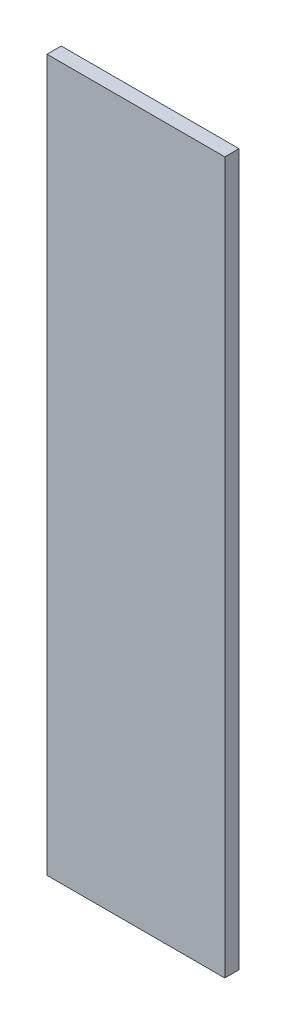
ISO-10303-21;
HEADER;
FILE_DESCRIPTION(('STEP AP214'),'2;1');
FILE_NAME('part.step','',(''),(''),'','','');
FILE_SCHEMA(('AUTOMOTIVE_DESIGN { 1 0 10303 214 1 1 1 1 }'));
ENDSEC;
DATA;
#1=APPLICATION_CONTEXT('core data for automotive mechanical design processes');
#2=APPLICATION_PROTOCOL_DEFINITION('international standard','automotive_design',2000,#1);
#3=PRODUCT_CONTEXT('',#1,'mechanical');
#4=PRODUCT('Part','Part','',(#3));
#5=PRODUCT_RELATED_PRODUCT_CATEGORY('part','',(#4));
#6=PRODUCT_DEFINITION_FORMATION('','',#4);
#7=PRODUCT_DEFINITION_CONTEXT('part definition',#1,'design');
#8=PRODUCT_DEFINITION('design','',#6,#7);
#9=PRODUCT_DEFINITION_SHAPE('','',#8);
#10=(LENGTH_UNIT() NAMED_UNIT(*) SI_UNIT(.MILLI.,.METRE.));
#11=(NAMED_UNIT(*) PLANE_ANGLE_UNIT() SI_UNIT($,.RADIAN.));
#12=(NAMED_UNIT(*) SI_UNIT($,.STERADIAN.) SOLID_ANGLE_UNIT());
#13=UNCERTAINTY_MEASURE_WITH_UNIT(LENGTH_MEASURE(1.E-05),#10,'distance_accuracy_value','');
#14=(GEOMETRIC_REPRESENTATION_CONTEXT(3) GLOBAL_UNCERTAINTY_ASSIGNED_CONTEXT((#13)) GLOBAL_UNIT_ASSIGNED_CONTEXT((#10,
#11,#12)) REPRESENTATION_CONTEXT('',''));
#15=CARTESIAN_POINT('',(0.,0.,0.));
#16=DIRECTION('',(0.,0.,1.));
#17=DIRECTION('',(1.,0.,0.));
#18=AXIS2_PLACEMENT_3D('',#15,#16,#17);
#19=CARTESIAN_POINT('',(-179.533444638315,18.516747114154,2.));
#20=DIRECTION('',(-1.,0.,0.));
#21=DIRECTION('',(0.,0.,1.));
#22=AXIS2_PLACEMENT_3D('',#19,#20,#21);
#23=PLANE('',#22);
#24=DIRECTION('',(0.,1.,0.));
#25=VECTOR('',#24,1.);
#26=CARTESIAN_POINT('',(-179.533444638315,18.516747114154,0.));
#27=LINE('',#26,#25);
#28=CARTESIAN_POINT('',(-179.533444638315,-81.483252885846,0.));
#29=VERTEX_POINT('',#28);
#30=CARTESIAN_POINT('',(-179.533444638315,18.516747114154,0.));
#31=VERTEX_POINT('',#30);
#32=EDGE_CURVE('E99',#29,#31,#27,.T.);
#33=ORIENTED_EDGE('',*,*,#32,.T.);
#34=DIRECTION('',(0.,0.,-1.));
#35=VECTOR('',#34,1.);
#36=CARTESIAN_POINT('',(-179.533444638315,18.516747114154,2.));
#37=LINE('',#36,#35);
#38=CARTESIAN_POINT('',(-179.533444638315,18.516747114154,2.));
#39=VERTEX_POINT('',#38);
#40=EDGE_CURVE('E11',#39,#31,#37,.T.);
#41=ORIENTED_EDGE('',*,*,#40,.F.);
#42=DIRECTION('',(0.,1.,0.));
#43=VECTOR('',#42,1.);
#44=CARTESIAN_POINT('',(-179.533444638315,18.516747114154,2.));
#45=LINE('',#44,#43);
#46=CARTESIAN_POINT('',(-179.533444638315,-81.483252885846,2.));
#47=VERTEX_POINT('',#46);
#48=EDGE_CURVE('E87',#47,#39,#45,.T.);
#49=ORIENTED_EDGE('',*,*,#48,.F.);
#50=DIRECTION('',(0.,0.,-1.));
#51=VECTOR('',#50,1.);
#52=CARTESIAN_POINT('',(-179.533444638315,-81.483252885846,2.));
#53=LINE('',#52,#51);
#54=EDGE_CURVE('E95',#47,#29,#53,.T.);
#55=ORIENTED_EDGE('',*,*,#54,.T.);
#56=EDGE_LOOP('',(#33,#41,#49,#55));
#57=FACE_BOUND('',#56,.T.);
#58=ADVANCED_FACE('F36',(#57),#23,.F.);
#59=CARTESIAN_POINT('',(-179.533444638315,18.516747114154,2.));
#60=DIRECTION('',(0.,-1.,0.));
#61=DIRECTION('',(0.,0.,-1.));
#62=AXIS2_PLACEMENT_3D('',#59,#60,#61);
#63=PLANE('',#62);
#64=DIRECTION('',(-1.,0.,0.));
#65=VECTOR('',#64,1.);
#66=CARTESIAN_POINT('',(-179.533444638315,18.516747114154,0.));
#67=LINE('',#66,#65);
#68=CARTESIAN_POINT('',(-204.533444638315,18.516747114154,0.));
#69=VERTEX_POINT('',#68);
#70=EDGE_CURVE('E91',#31,#69,#67,.T.);
#71=ORIENTED_EDGE('',*,*,#70,.T.);
#72=DIRECTION('',(0.,0.,-1.));
#73=VECTOR('',#72,1.);
#74=CARTESIAN_POINT('',(-204.533444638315,18.516747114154,2.));
#75=LINE('',#74,#73);
#76=CARTESIAN_POINT('',(-204.533444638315,18.516747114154,2.));
#77=VERTEX_POINT('',#76);
#78=EDGE_CURVE('E44',#77,#69,#75,.T.);
#79=ORIENTED_EDGE('',*,*,#78,.F.);
#80=DIRECTION('',(-1.,0.,0.));
#81=VECTOR('',#80,1.);
#82=CARTESIAN_POINT('',(-179.533444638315,18.516747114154,2.));
#83=LINE('',#82,#81);
#84=EDGE_CURVE('E82',#39,#77,#83,.T.);
#85=ORIENTED_EDGE('',*,*,#84,.F.);
#86=ORIENTED_EDGE('',*,*,#40,.T.);
#87=EDGE_LOOP('',(#71,#79,#85,#86));
#88=FACE_BOUND('',#87,.T.);
#89=ADVANCED_FACE('F90',(#88),#63,.F.);
#90=CARTESIAN_POINT('',(-204.533444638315,18.516747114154,2.));
#91=DIRECTION('',(1.,0.,0.));
#92=DIRECTION('',(0.,1.,0.));
#93=AXIS2_PLACEMENT_3D('',#90,#91,#92);
#94=PLANE('',#93);
#95=DIRECTION('',(0.,-1.,0.));
#96=VECTOR('',#95,1.);
#97=CARTESIAN_POINT('',(-204.533444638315,18.516747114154,0.));
#98=LINE('',#97,#96);
#99=CARTESIAN_POINT('',(-204.533444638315,-81.483252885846,0.));
#100=VERTEX_POINT('',#99);
#101=EDGE_CURVE('E69',#69,#100,#98,.T.);
#102=ORIENTED_EDGE('',*,*,#101,.T.);
#103=DIRECTION('',(0.,0.,-1.));
#104=VECTOR('',#103,1.);
#105=CARTESIAN_POINT('',(-204.533444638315,-81.483252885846,2.));
#106=LINE('',#105,#104);
#107=CARTESIAN_POINT('',(-204.533444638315,-81.483252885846,2.));
#108=VERTEX_POINT('',#107);
#109=EDGE_CURVE('E92',#108,#100,#106,.T.);
#110=ORIENTED_EDGE('',*,*,#109,.F.);
#111=DIRECTION('',(0.,-1.,0.));
#112=VECTOR('',#111,1.);
#113=CARTESIAN_POINT('',(-204.533444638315,18.516747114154,2.));
#114=LINE('',#113,#112);
#115=EDGE_CURVE('E85',#77,#108,#114,.T.);
#116=ORIENTED_EDGE('',*,*,#115,.F.);
#117=ORIENTED_EDGE('',*,*,#78,.T.);
#118=EDGE_LOOP('',(#102,#110,#116,#117));
#119=FACE_BOUND('',#118,.T.);
#120=ADVANCED_FACE('F93',(#119),#94,.F.);
#121=CARTESIAN_POINT('',(-179.533444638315,-81.483252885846,2.));
#122=DIRECTION('',(0.,1.,0.));
#123=DIRECTION('',(-1.,0.,0.));
#124=AXIS2_PLACEMENT_3D('',#121,#122,#123);
#125=PLANE('',#124);
#126=DIRECTION('',(1.,0.,0.));
#127=VECTOR('',#126,1.);
#128=CARTESIAN_POINT('',(-179.533444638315,-81.483252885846,0.));
#129=LINE('',#128,#127);
#130=EDGE_CURVE('E75',#100,#29,#129,.T.);
#131=ORIENTED_EDGE('',*,*,#130,.T.);
#132=ORIENTED_EDGE('',*,*,#54,.F.);
#133=DIRECTION('',(1.,0.,0.));
#134=VECTOR('',#133,1.);
#135=CARTESIAN_POINT('',(-179.533444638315,-81.483252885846,2.));
#136=LINE('',#135,#134);
#137=EDGE_CURVE('E52',#108,#47,#136,.T.);
#138=ORIENTED_EDGE('',*,*,#137,.F.);
#139=ORIENTED_EDGE('',*,*,#109,.T.);
#140=EDGE_LOOP('',(#131,#132,#138,#139));
#141=FACE_BOUND('',#140,.T.);
#142=ADVANCED_FACE('F106',(#141),#125,.F.);
#143=CARTESIAN_POINT('',(-179.533444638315,-81.483252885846,2.));
#144=DIRECTION('',(0.,0.,-1.));
#145=DIRECTION('',(-1.,0.,0.));
#146=AXIS2_PLACEMENT_3D('',#143,#144,#145);
#147=PLANE('',#146);
#148=ORIENTED_EDGE('',*,*,#48,.T.);
#149=ORIENTED_EDGE('',*,*,#84,.T.);
#150=ORIENTED_EDGE('',*,*,#115,.T.);
#151=ORIENTED_EDGE('',*,*,#137,.T.);
#152=EDGE_LOOP('',(#148,#149,#150,#151));
#153=FACE_BOUND('',#152,.T.);
#154=ADVANCED_FACE('F83',(#153),#147,.F.);
#155=CARTESIAN_POINT('',(-179.533444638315,-81.483252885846,0.));
#156=DIRECTION('',(0.,0.,-1.));
#157=DIRECTION('',(-1.,0.,0.));
#158=AXIS2_PLACEMENT_3D('',#155,#156,#157);
#159=PLANE('',#158);
#160=ORIENTED_EDGE('',*,*,#32,.F.);
#161=ORIENTED_EDGE('',*,*,#130,.F.);
#162=ORIENTED_EDGE('',*,*,#101,.F.);
#163=ORIENTED_EDGE('',*,*,#70,.F.);
#164=EDGE_LOOP('',(#160,#161,#162,#163));
#165=FACE_BOUND('',#164,.T.);
#166=ADVANCED_FACE('F109',(#165),#159,.T.);
#167=CLOSED_SHELL('',(#58,#89,#120,#142,#154,#166));
#168=MANIFOLD_SOLID_BREP('B2',#167);
#169=ADVANCED_BREP_SHAPE_REPRESENTATION('',(#18,#168),#14);
#170=SHAPE_DEFINITION_REPRESENTATION(#9,#169);
ENDSEC;
END-ISO-10303-21;
